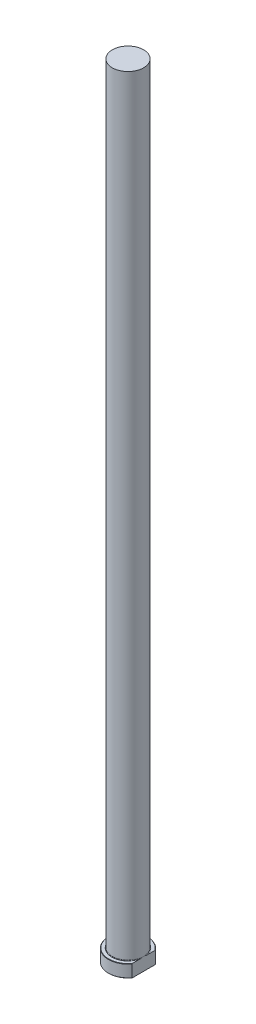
from build123d import *
from build123d.topology import SkipClean

# Parameters (mm, degrees)
CHAMFER1_SIZE    = 0.2
FILLET1_R        = 0.3
KEYED_HEAD_DEPTH = 501.312402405


with BuildPart() as part:
    # Sketch1 → Revolve1 (revolve)
    with BuildSketch(Plane.XY, mode=Mode.PRIVATE) as revolve1_sk:
        Polygon((0, 0), (-12.5, 0), (-12.5, 8), (-10, 8), (-10, 500), (0, 500), align=None)
    revolve(revolve1_sk.sketch.rotate(Axis((0, 259.958771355, 0), (0, -1, 0)), 270), axis=Axis((0, 259.958771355, 0), (0, -1, 0)))

    # Chamfer1
    chamfer1_edges = [part.edges().sort_by_distance(p)[0] for p in [
        (0, 8, -12.5),
        (0, 0, -12.5),
    ]]
    chamfer(chamfer1_edges, length=CHAMFER1_SIZE)

    # Fillet1
    fillet1_edges = [part.edges().sort_by_distance(p)[0] for p in [
        (0, 8, -10),
    ]]
    fillet(fillet1_edges, radius=FILLET1_R)

    # Sketch2 → KEYED HEAD (cut, through all)
    with SkipClean():  # the faces are left unmerged after this step: merging them gives an invalid solid
        with BuildSketch(Plane(origin=(0, 0, 0), x_dir=(1, 0, 0), z_dir=(0, 1, 0))):
            with BuildLine():
                Line((10, -7.5), (10, 7.5))
                ThreePointArc((10, 7.5), (12.5, 0), (10, -7.5))
            make_face()
        extrude(amount=KEYED_HEAD_DEPTH, mode=Mode.SUBTRACT)


solid = part.part
